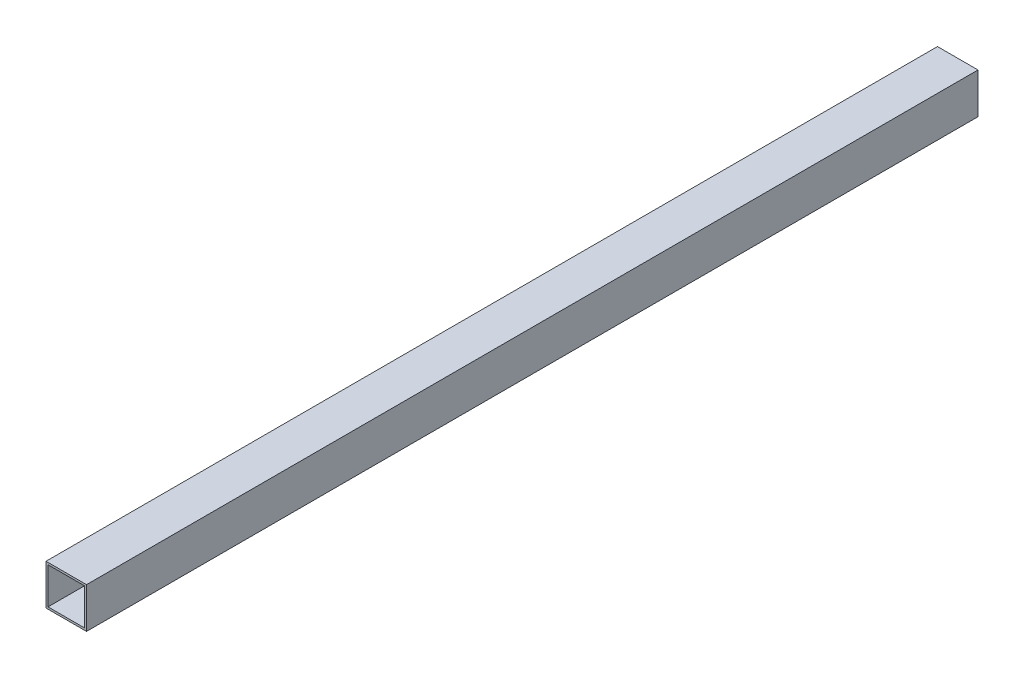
ISO-10303-21;
HEADER;
FILE_DESCRIPTION(('STEP AP214'),'2;1');
FILE_NAME('part.step','',(''),(''),'','','');
FILE_SCHEMA(('AUTOMOTIVE_DESIGN { 1 0 10303 214 1 1 1 1 }'));
ENDSEC;
DATA;
#1=APPLICATION_CONTEXT('core data for automotive mechanical design processes');
#2=APPLICATION_PROTOCOL_DEFINITION('international standard','automotive_design',2000,#1);
#3=PRODUCT_CONTEXT('',#1,'mechanical');
#4=PRODUCT('Part','Part','',(#3));
#5=PRODUCT_RELATED_PRODUCT_CATEGORY('part','',(#4));
#6=PRODUCT_DEFINITION_FORMATION('','',#4);
#7=PRODUCT_DEFINITION_CONTEXT('part definition',#1,'design');
#8=PRODUCT_DEFINITION('design','',#6,#7);
#9=PRODUCT_DEFINITION_SHAPE('','',#8);
#10=(LENGTH_UNIT() NAMED_UNIT(*) SI_UNIT(.MILLI.,.METRE.));
#11=(NAMED_UNIT(*) PLANE_ANGLE_UNIT() SI_UNIT($,.RADIAN.));
#12=(NAMED_UNIT(*) SI_UNIT($,.STERADIAN.) SOLID_ANGLE_UNIT());
#13=UNCERTAINTY_MEASURE_WITH_UNIT(LENGTH_MEASURE(1.E-05),#10,'distance_accuracy_value','');
#14=(GEOMETRIC_REPRESENTATION_CONTEXT(3) GLOBAL_UNCERTAINTY_ASSIGNED_CONTEXT((#13)) GLOBAL_UNIT_ASSIGNED_CONTEXT((#10,
#11,#12)) REPRESENTATION_CONTEXT('',''));
#15=CARTESIAN_POINT('',(0.,0.,0.));
#16=DIRECTION('',(0.,0.,1.));
#17=DIRECTION('',(1.,0.,0.));
#18=AXIS2_PLACEMENT_3D('',#15,#16,#17);
#19=CARTESIAN_POINT('',(0.,0.,2200.));
#20=DIRECTION('',(0.,0.,-1.));
#21=DIRECTION('',(-1.,0.,0.));
#22=AXIS2_PLACEMENT_3D('',#19,#20,#21);
#23=PLANE('',#22);
#24=DIRECTION('',(0.,-1.,0.));
#25=VECTOR('',#24,1.);
#26=CARTESIAN_POINT('',(0.,0.,2200.));
#27=LINE('',#26,#25);
#28=CARTESIAN_POINT('',(0.,100.,2200.));
#29=VERTEX_POINT('',#28);
#30=CARTESIAN_POINT('',(0.,0.,2200.));
#31=VERTEX_POINT('',#30);
#32=EDGE_CURVE('E140',#29,#31,#27,.T.);
#33=ORIENTED_EDGE('',*,*,#32,.T.);
#34=DIRECTION('',(1.,0.,0.));
#35=VECTOR('',#34,1.);
#36=CARTESIAN_POINT('',(0.,0.,2200.));
#37=LINE('',#36,#35);
#38=CARTESIAN_POINT('',(100.,0.,2200.));
#39=VERTEX_POINT('',#38);
#40=EDGE_CURVE('E143',#31,#39,#37,.T.);
#41=ORIENTED_EDGE('',*,*,#40,.T.);
#42=DIRECTION('',(0.,1.,0.));
#43=VECTOR('',#42,1.);
#44=CARTESIAN_POINT('',(100.,0.,2200.));
#45=LINE('',#44,#43);
#46=CARTESIAN_POINT('',(100.,100.,2200.));
#47=VERTEX_POINT('',#46);
#48=EDGE_CURVE('E146',#39,#47,#45,.T.);
#49=ORIENTED_EDGE('',*,*,#48,.T.);
#50=DIRECTION('',(-1.,0.,0.));
#51=VECTOR('',#50,1.);
#52=CARTESIAN_POINT('',(0.,100.,2200.));
#53=LINE('',#52,#51);
#54=EDGE_CURVE('E148',#47,#29,#53,.T.);
#55=ORIENTED_EDGE('',*,*,#54,.T.);
#56=EDGE_LOOP('',(#33,#41,#49,#55));
#57=FACE_BOUND('',#56,.T.);
#58=DIRECTION('',(0.,-1.,0.));
#59=VECTOR('',#58,1.);
#60=CARTESIAN_POINT('',(5.,5.,2200.));
#61=LINE('',#60,#59);
#62=CARTESIAN_POINT('',(5.,95.,2200.));
#63=VERTEX_POINT('',#62);
#64=CARTESIAN_POINT('',(5.,5.,2200.));
#65=VERTEX_POINT('',#64);
#66=EDGE_CURVE('E104',#63,#65,#61,.T.);
#67=ORIENTED_EDGE('',*,*,#66,.F.);
#68=DIRECTION('',(-1.,0.,0.));
#69=VECTOR('',#68,1.);
#70=CARTESIAN_POINT('',(5.,95.,2200.));
#71=LINE('',#70,#69);
#72=CARTESIAN_POINT('',(95.,95.,2200.));
#73=VERTEX_POINT('',#72);
#74=EDGE_CURVE('E126',#73,#63,#71,.T.);
#75=ORIENTED_EDGE('',*,*,#74,.F.);
#76=DIRECTION('',(0.,1.,0.));
#77=VECTOR('',#76,1.);
#78=CARTESIAN_POINT('',(95.,5.,2200.));
#79=LINE('',#78,#77);
#80=CARTESIAN_POINT('',(95.,5.,2200.));
#81=VERTEX_POINT('',#80);
#82=EDGE_CURVE('E124',#81,#73,#79,.T.);
#83=ORIENTED_EDGE('',*,*,#82,.F.);
#84=DIRECTION('',(1.,0.,0.));
#85=VECTOR('',#84,1.);
#86=CARTESIAN_POINT('',(5.,5.,2200.));
#87=LINE('',#86,#85);
#88=EDGE_CURVE('E112',#65,#81,#87,.T.);
#89=ORIENTED_EDGE('',*,*,#88,.F.);
#90=EDGE_LOOP('',(#67,#75,#83,#89));
#91=FACE_BOUND('',#90,.T.);
#92=ADVANCED_FACE('F39',(#57,#91),#23,.F.);
#93=CARTESIAN_POINT('',(0.,0.,0.));
#94=DIRECTION('',(0.,0.,-1.));
#95=DIRECTION('',(-1.,0.,0.));
#96=AXIS2_PLACEMENT_3D('',#93,#94,#95);
#97=PLANE('',#96);
#98=DIRECTION('',(0.,-1.,0.));
#99=VECTOR('',#98,1.);
#100=CARTESIAN_POINT('',(0.,0.,0.));
#101=LINE('',#100,#99);
#102=CARTESIAN_POINT('',(0.,100.,0.));
#103=VERTEX_POINT('',#102);
#104=CARTESIAN_POINT('',(0.,0.,0.));
#105=VERTEX_POINT('',#104);
#106=EDGE_CURVE('E120',#103,#105,#101,.T.);
#107=ORIENTED_EDGE('',*,*,#106,.F.);
#108=DIRECTION('',(-1.,0.,0.));
#109=VECTOR('',#108,1.);
#110=CARTESIAN_POINT('',(0.,100.,0.));
#111=LINE('',#110,#109);
#112=CARTESIAN_POINT('',(100.,100.,0.));
#113=VERTEX_POINT('',#112);
#114=EDGE_CURVE('E144',#113,#103,#111,.T.);
#115=ORIENTED_EDGE('',*,*,#114,.F.);
#116=DIRECTION('',(0.,1.,0.));
#117=VECTOR('',#116,1.);
#118=CARTESIAN_POINT('',(100.,0.,0.));
#119=LINE('',#118,#117);
#120=CARTESIAN_POINT('',(100.,0.,0.));
#121=VERTEX_POINT('',#120);
#122=EDGE_CURVE('E155',#121,#113,#119,.T.);
#123=ORIENTED_EDGE('',*,*,#122,.F.);
#124=DIRECTION('',(1.,0.,0.));
#125=VECTOR('',#124,1.);
#126=CARTESIAN_POINT('',(0.,0.,0.));
#127=LINE('',#126,#125);
#128=EDGE_CURVE('E153',#105,#121,#127,.T.);
#129=ORIENTED_EDGE('',*,*,#128,.F.);
#130=EDGE_LOOP('',(#107,#115,#123,#129));
#131=FACE_BOUND('',#130,.T.);
#132=DIRECTION('',(-1.,0.,0.));
#133=VECTOR('',#132,1.);
#134=CARTESIAN_POINT('',(5.,95.,0.));
#135=LINE('',#134,#133);
#136=CARTESIAN_POINT('',(95.,95.,0.));
#137=VERTEX_POINT('',#136);
#138=CARTESIAN_POINT('',(5.,95.,0.));
#139=VERTEX_POINT('',#138);
#140=EDGE_CURVE('E113',#137,#139,#135,.T.);
#141=ORIENTED_EDGE('',*,*,#140,.T.);
#142=DIRECTION('',(0.,-1.,0.));
#143=VECTOR('',#142,1.);
#144=CARTESIAN_POINT('',(5.,5.,0.));
#145=LINE('',#144,#143);
#146=CARTESIAN_POINT('',(5.,5.,0.));
#147=VERTEX_POINT('',#146);
#148=EDGE_CURVE('E62',#139,#147,#145,.T.);
#149=ORIENTED_EDGE('',*,*,#148,.T.);
#150=DIRECTION('',(1.,0.,0.));
#151=VECTOR('',#150,1.);
#152=CARTESIAN_POINT('',(5.,5.,0.));
#153=LINE('',#152,#151);
#154=CARTESIAN_POINT('',(95.,5.,0.));
#155=VERTEX_POINT('',#154);
#156=EDGE_CURVE('E119',#147,#155,#153,.T.);
#157=ORIENTED_EDGE('',*,*,#156,.T.);
#158=DIRECTION('',(0.,1.,0.));
#159=VECTOR('',#158,1.);
#160=CARTESIAN_POINT('',(95.,5.,0.));
#161=LINE('',#160,#159);
#162=EDGE_CURVE('E132',#155,#137,#161,.T.);
#163=ORIENTED_EDGE('',*,*,#162,.T.);
#164=EDGE_LOOP('',(#141,#149,#157,#163));
#165=FACE_BOUND('',#164,.T.);
#166=ADVANCED_FACE('F173',(#131,#165),#97,.T.);
#167=CARTESIAN_POINT('',(0.,0.,2200.));
#168=DIRECTION('',(1.,0.,0.));
#169=DIRECTION('',(0.,0.,-1.));
#170=AXIS2_PLACEMENT_3D('',#167,#168,#169);
#171=PLANE('',#170);
#172=ORIENTED_EDGE('',*,*,#106,.T.);
#173=DIRECTION('',(0.,0.,-1.));
#174=VECTOR('',#173,1.);
#175=CARTESIAN_POINT('',(0.,0.,2200.));
#176=LINE('',#175,#174);
#177=EDGE_CURVE('E11',#31,#105,#176,.T.);
#178=ORIENTED_EDGE('',*,*,#177,.F.);
#179=ORIENTED_EDGE('',*,*,#32,.F.);
#180=DIRECTION('',(0.,0.,-1.));
#181=VECTOR('',#180,1.);
#182=CARTESIAN_POINT('',(0.,100.,2200.));
#183=LINE('',#182,#181);
#184=EDGE_CURVE('E150',#29,#103,#183,.T.);
#185=ORIENTED_EDGE('',*,*,#184,.T.);
#186=EDGE_LOOP('',(#172,#178,#179,#185));
#187=FACE_BOUND('',#186,.T.);
#188=ADVANCED_FACE('F41',(#187),#171,.F.);
#189=CARTESIAN_POINT('',(0.,0.,2200.));
#190=DIRECTION('',(0.,1.,0.));
#191=DIRECTION('',(0.,0.,1.));
#192=AXIS2_PLACEMENT_3D('',#189,#190,#191);
#193=PLANE('',#192);
#194=ORIENTED_EDGE('',*,*,#128,.T.);
#195=DIRECTION('',(0.,0.,-1.));
#196=VECTOR('',#195,1.);
#197=CARTESIAN_POINT('',(100.,0.,2200.));
#198=LINE('',#197,#196);
#199=EDGE_CURVE('E47',#39,#121,#198,.T.);
#200=ORIENTED_EDGE('',*,*,#199,.F.);
#201=ORIENTED_EDGE('',*,*,#40,.F.);
#202=ORIENTED_EDGE('',*,*,#177,.T.);
#203=EDGE_LOOP('',(#194,#200,#201,#202));
#204=FACE_BOUND('',#203,.T.);
#205=ADVANCED_FACE('F183',(#204),#193,.F.);
#206=CARTESIAN_POINT('',(100.,0.,2200.));
#207=DIRECTION('',(-1.,0.,0.));
#208=DIRECTION('',(0.,0.,1.));
#209=AXIS2_PLACEMENT_3D('',#206,#207,#208);
#210=PLANE('',#209);
#211=ORIENTED_EDGE('',*,*,#122,.T.);
#212=DIRECTION('',(0.,0.,-1.));
#213=VECTOR('',#212,1.);
#214=CARTESIAN_POINT('',(100.,100.,2200.));
#215=LINE('',#214,#213);
#216=EDGE_CURVE('E160',#47,#113,#215,.T.);
#217=ORIENTED_EDGE('',*,*,#216,.F.);
#218=ORIENTED_EDGE('',*,*,#48,.F.);
#219=ORIENTED_EDGE('',*,*,#199,.T.);
#220=EDGE_LOOP('',(#211,#217,#218,#219));
#221=FACE_BOUND('',#220,.T.);
#222=ADVANCED_FACE('F167',(#221),#210,.F.);
#223=CARTESIAN_POINT('',(0.,100.,2200.));
#224=DIRECTION('',(0.,-1.,0.));
#225=DIRECTION('',(0.,0.,-1.));
#226=AXIS2_PLACEMENT_3D('',#223,#224,#225);
#227=PLANE('',#226);
#228=ORIENTED_EDGE('',*,*,#114,.T.);
#229=ORIENTED_EDGE('',*,*,#184,.F.);
#230=ORIENTED_EDGE('',*,*,#54,.F.);
#231=ORIENTED_EDGE('',*,*,#216,.T.);
#232=EDGE_LOOP('',(#228,#229,#230,#231));
#233=FACE_BOUND('',#232,.T.);
#234=ADVANCED_FACE('F177',(#233),#227,.F.);
#235=CARTESIAN_POINT('',(5.,5.,2200.));
#236=DIRECTION('',(1.,0.,0.));
#237=DIRECTION('',(0.,0.,-1.));
#238=AXIS2_PLACEMENT_3D('',#235,#236,#237);
#239=PLANE('',#238);
#240=ORIENTED_EDGE('',*,*,#148,.F.);
#241=DIRECTION('',(0.,0.,-1.));
#242=VECTOR('',#241,1.);
#243=CARTESIAN_POINT('',(5.,95.,2200.));
#244=LINE('',#243,#242);
#245=EDGE_CURVE('E108',#63,#139,#244,.T.);
#246=ORIENTED_EDGE('',*,*,#245,.F.);
#247=ORIENTED_EDGE('',*,*,#66,.T.);
#248=DIRECTION('',(0.,0.,-1.));
#249=VECTOR('',#248,1.);
#250=CARTESIAN_POINT('',(5.,5.,2200.));
#251=LINE('',#250,#249);
#252=EDGE_CURVE('E107',#65,#147,#251,.T.);
#253=ORIENTED_EDGE('',*,*,#252,.T.);
#254=EDGE_LOOP('',(#240,#246,#247,#253));
#255=FACE_BOUND('',#254,.T.);
#256=ADVANCED_FACE('F106',(#255),#239,.T.);
#257=CARTESIAN_POINT('',(5.,5.,2200.));
#258=DIRECTION('',(0.,1.,0.));
#259=DIRECTION('',(0.,0.,1.));
#260=AXIS2_PLACEMENT_3D('',#257,#258,#259);
#261=PLANE('',#260);
#262=ORIENTED_EDGE('',*,*,#156,.F.);
#263=ORIENTED_EDGE('',*,*,#252,.F.);
#264=ORIENTED_EDGE('',*,*,#88,.T.);
#265=DIRECTION('',(0.,0.,-1.));
#266=VECTOR('',#265,1.);
#267=CARTESIAN_POINT('',(95.,5.,2200.));
#268=LINE('',#267,#266);
#269=EDGE_CURVE('E121',#81,#155,#268,.T.);
#270=ORIENTED_EDGE('',*,*,#269,.T.);
#271=EDGE_LOOP('',(#262,#263,#264,#270));
#272=FACE_BOUND('',#271,.T.);
#273=ADVANCED_FACE('F116',(#272),#261,.T.);
#274=CARTESIAN_POINT('',(95.,5.,2200.));
#275=DIRECTION('',(-1.,0.,0.));
#276=DIRECTION('',(0.,0.,1.));
#277=AXIS2_PLACEMENT_3D('',#274,#275,#276);
#278=PLANE('',#277);
#279=ORIENTED_EDGE('',*,*,#162,.F.);
#280=ORIENTED_EDGE('',*,*,#269,.F.);
#281=ORIENTED_EDGE('',*,*,#82,.T.);
#282=DIRECTION('',(0.,0.,-1.));
#283=VECTOR('',#282,1.);
#284=CARTESIAN_POINT('',(95.,95.,2200.));
#285=LINE('',#284,#283);
#286=EDGE_CURVE('E54',#73,#137,#285,.T.);
#287=ORIENTED_EDGE('',*,*,#286,.T.);
#288=EDGE_LOOP('',(#279,#280,#281,#287));
#289=FACE_BOUND('',#288,.T.);
#290=ADVANCED_FACE('F206',(#289),#278,.T.);
#291=CARTESIAN_POINT('',(5.,95.,2200.));
#292=DIRECTION('',(0.,-1.,0.));
#293=DIRECTION('',(0.,0.,-1.));
#294=AXIS2_PLACEMENT_3D('',#291,#292,#293);
#295=PLANE('',#294);
#296=ORIENTED_EDGE('',*,*,#140,.F.);
#297=ORIENTED_EDGE('',*,*,#286,.F.);
#298=ORIENTED_EDGE('',*,*,#74,.T.);
#299=ORIENTED_EDGE('',*,*,#245,.T.);
#300=EDGE_LOOP('',(#296,#297,#298,#299));
#301=FACE_BOUND('',#300,.T.);
#302=ADVANCED_FACE('F210',(#301),#295,.T.);
#303=CLOSED_SHELL('',(#92,#166,#188,#205,#222,#234,#256,#273,#290,#302));
#304=MANIFOLD_SOLID_BREP('B2',#303);
#305=ADVANCED_BREP_SHAPE_REPRESENTATION('',(#18,#304),#14);
#306=SHAPE_DEFINITION_REPRESENTATION(#9,#305);
ENDSEC;
END-ISO-10303-21;
